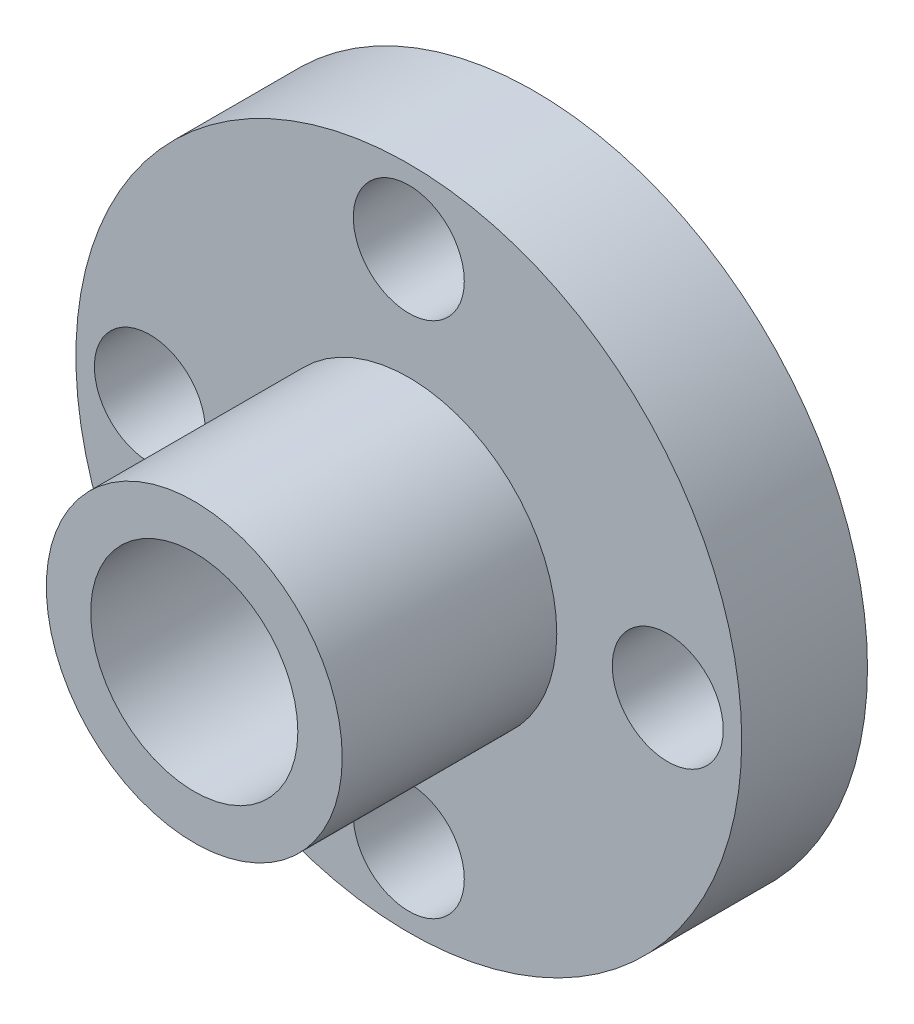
from build123d import *

# Parameters (mm, degrees)
SKETCH1_W          = 85
SKETCH1_H          = 225
SKETCH1_W_2        = 145
SKETCH1_H_2        = 100
SKETCH2_R          = 70
CUT_EXTRUDE1_DEPTH = 230
SKETCH3_R          = 37.5
CUT_EXTRUDE3_DEPTH = 350.678423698


with BuildPart() as part:
    # Sketch1 → Revolve1 (revolve)
    with BuildSketch(Plane(origin=(0, 0, 0), x_dir=(0, 0, -1), z_dir=(1, 0, 0)), mode=Mode.PRIVATE) as revolve1_sk:
        with Locations((42.5, 112.5)):
            Rectangle(SKETCH1_W, SKETCH1_H)
        with Locations((-72.5, 50)):
            Rectangle(SKETCH1_W_2, SKETCH1_H_2)
    revolve(revolve1_sk.sketch.rotate(Axis((0, 0, 277.296664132), (0, 0, -1)), 90), axis=Axis((0, 0, 277.296664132), (0, 0, -1)))

    # Sketch2 → Cut-Extrude1 (cut)
    with BuildSketch(Plane.XY.offset(145)):
        Circle(SKETCH2_R)
    extrude(amount=-CUT_EXTRUDE1_DEPTH, mode=Mode.SUBTRACT)

    # Sketch3 → Cut-Extrude3 (cut, through all)
    with BuildSketch(Plane.XY):
        with Locations((0, 175)):
            Circle(SKETCH3_R)
        with Locations((175, 0)):
            Circle(SKETCH3_R)
        with Locations((0, -175)):
            Circle(SKETCH3_R)
        with Locations((-175, 0)):
            Circle(SKETCH3_R)
    extrude(amount=-CUT_EXTRUDE3_DEPTH, mode=Mode.SUBTRACT)


solid = part.part
